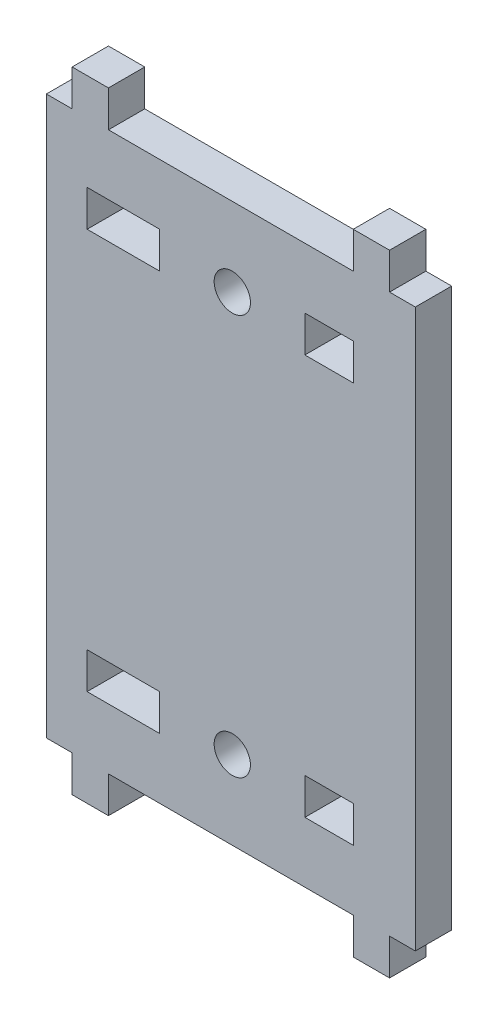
from build123d import *

# Parameters (mm, degrees)
SKETCH1_R           = 1.5
SKETCH1_W           = 6
SKETCH1_H           = 3
SKETCH1_W_2         = 4
BOSS_EXTRUDE1_DEPTH = 3


with BuildPart() as part:
    # Sketch1 → Boss-Extrude1 (new body)
    with BuildSketch(Plane.XY):
        Polygon((71.188714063, 159.941147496), (74.188714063, 159.941147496), (74.188714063, 162.941147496), (76.320599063, 162.941147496), (76.320599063, 209.041147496), (74.188714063, 209.041147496), (74.188714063, 212.041147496), (71.188714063, 212.041147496), (71.188714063, 209.041147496), (50.952483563, 209.041147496), (50.952483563, 212.041147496), (47.952483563, 212.041147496), (47.952483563, 209.041147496), (45.820598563, 209.041147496), (45.820598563, 162.941147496), (47.952483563, 162.941147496), (47.952483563, 159.941147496), (50.952483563, 159.941147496), (50.952483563, 162.941147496), (71.188714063, 162.941147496), align=None)
        with Locations((61.188714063, 202.541147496)):
            Circle(SKETCH1_R, mode=Mode.SUBTRACT)
        with Locations((61.188714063, 169.441147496)):
            Circle(SKETCH1_R, mode=Mode.SUBTRACT)
        with Locations((52.188714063, 202.541147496)):
            Rectangle(SKETCH1_W, SKETCH1_H, mode=Mode.SUBTRACT)
        with Locations((69.188714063, 202.541147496)):
            Rectangle(SKETCH1_W_2, SKETCH1_H, mode=Mode.SUBTRACT)
        with Locations((52.188714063, 169.441147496)):
            Rectangle(SKETCH1_W, SKETCH1_H, mode=Mode.SUBTRACT)
        with Locations((69.188714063, 169.441147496)):
            Rectangle(SKETCH1_W_2, SKETCH1_H, mode=Mode.SUBTRACT)
    extrude(amount=BOSS_EXTRUDE1_DEPTH)


solid = part.part
